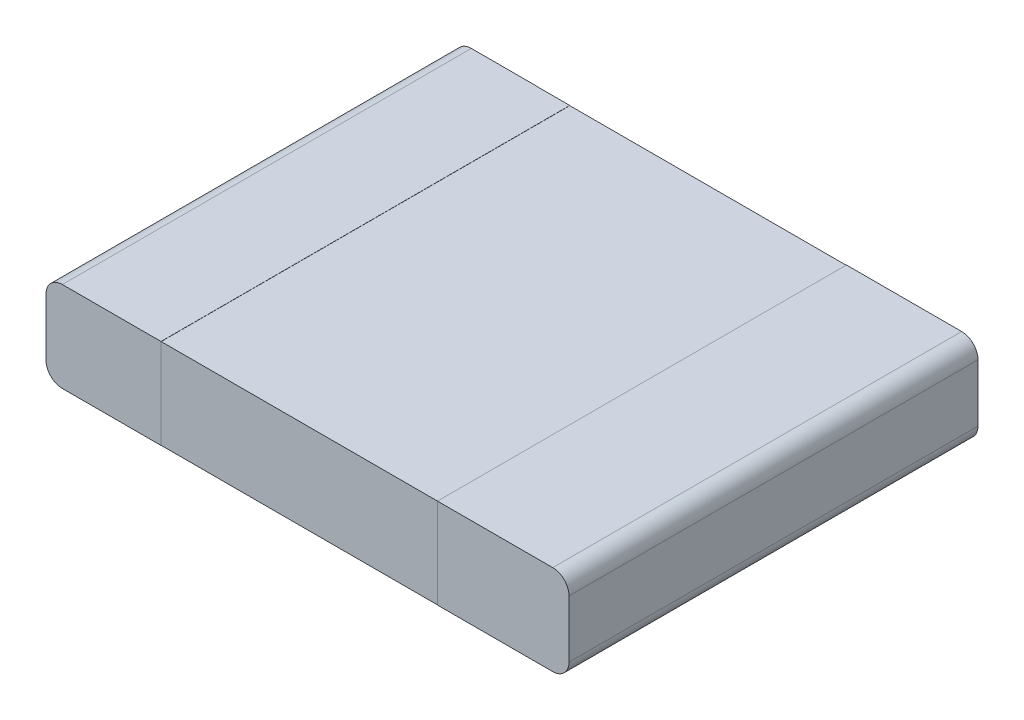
ISO-10303-21;
HEADER;
FILE_DESCRIPTION(('STEP AP214'),'2;1');
FILE_NAME('part.step','',(''),(''),'','','');
FILE_SCHEMA(('AUTOMOTIVE_DESIGN { 1 0 10303 214 1 1 1 1 }'));
ENDSEC;
DATA;
#1=APPLICATION_CONTEXT('core data for automotive mechanical design processes');
#2=APPLICATION_PROTOCOL_DEFINITION('international standard','automotive_design',2000,#1);
#3=PRODUCT_CONTEXT('',#1,'mechanical');
#4=PRODUCT('Part','Part','',(#3));
#5=PRODUCT_RELATED_PRODUCT_CATEGORY('part','',(#4));
#6=PRODUCT_DEFINITION_FORMATION('','',#4);
#7=PRODUCT_DEFINITION_CONTEXT('part definition',#1,'design');
#8=PRODUCT_DEFINITION('design','',#6,#7);
#9=PRODUCT_DEFINITION_SHAPE('','',#8);
#10=(LENGTH_UNIT() NAMED_UNIT(*) SI_UNIT(.MILLI.,.METRE.));
#11=(NAMED_UNIT(*) PLANE_ANGLE_UNIT() SI_UNIT($,.RADIAN.));
#12=(NAMED_UNIT(*) SI_UNIT($,.STERADIAN.) SOLID_ANGLE_UNIT());
#13=UNCERTAINTY_MEASURE_WITH_UNIT(LENGTH_MEASURE(1.E-05),#10,'distance_accuracy_value','');
#14=(GEOMETRIC_REPRESENTATION_CONTEXT(3) GLOBAL_UNCERTAINTY_ASSIGNED_CONTEXT((#13)) GLOBAL_UNIT_ASSIGNED_CONTEXT((#10,
#11,#12)) REPRESENTATION_CONTEXT('',''));
#15=CARTESIAN_POINT('',(0.,0.,0.));
#16=DIRECTION('',(0.,0.,1.));
#17=DIRECTION('',(1.,0.,0.));
#18=AXIS2_PLACEMENT_3D('',#15,#16,#17);
#19=CARTESIAN_POINT('',(0.,0.55,0.));
#20=DIRECTION('',(0.,1.,0.));
#21=DIRECTION('',(0.,0.,1.));
#22=AXIS2_PLACEMENT_3D('',#19,#20,#21);
#23=PLANE('',#22);
#24=DIRECTION('',(1.,0.,0.));
#25=VECTOR('',#24,1.);
#26=CARTESIAN_POINT('',(0.,0.55,-1.875));
#27=LINE('',#26,#25);
#28=CARTESIAN_POINT('',(1.39513527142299,0.55,-1.875));
#29=VERTEX_POINT('',#28);
#30=CARTESIAN_POINT('',(-0.296475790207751,0.55,-1.875));
#31=VERTEX_POINT('',#30);
#32=EDGE_CURVE('E225',#29,#31,#27,.F.);
#33=ORIENTED_EDGE('',*,*,#32,.T.);
#34=DIRECTION('',(0.,0.,1.));
#35=VECTOR('',#34,1.);
#36=CARTESIAN_POINT('',(-0.296475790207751,0.55,0.625));
#37=LINE('',#36,#35);
#38=CARTESIAN_POINT('',(-0.296475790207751,0.55,0.625));
#39=VERTEX_POINT('',#38);
#40=EDGE_CURVE('E206',#31,#39,#37,.T.);
#41=ORIENTED_EDGE('',*,*,#40,.T.);
#42=DIRECTION('',(1.,0.,0.));
#43=VECTOR('',#42,1.);
#44=CARTESIAN_POINT('',(0.,0.55,0.625));
#45=LINE('',#44,#43);
#46=CARTESIAN_POINT('',(1.39513527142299,0.55,0.625));
#47=VERTEX_POINT('',#46);
#48=EDGE_CURVE('E233',#39,#47,#45,.T.);
#49=ORIENTED_EDGE('',*,*,#48,.T.);
#50=DIRECTION('',(0.,0.,-1.));
#51=VECTOR('',#50,1.);
#52=CARTESIAN_POINT('',(1.39513527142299,0.55,0.625));
#53=LINE('',#52,#51);
#54=EDGE_CURVE('E228',#47,#29,#53,.T.);
#55=ORIENTED_EDGE('',*,*,#54,.T.);
#56=EDGE_LOOP('',(#33,#41,#49,#55));
#57=FACE_BOUND('',#56,.T.);
#58=ADVANCED_FACE('F19',(#57),#23,.T.);
#59=CARTESIAN_POINT('',(-0.296475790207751,0.551,0.625));
#60=DIRECTION('',(-1.,0.,0.));
#61=DIRECTION('',(0.,0.,1.));
#62=AXIS2_PLACEMENT_3D('',#59,#60,#61);
#63=PLANE('',#62);
#64=DIRECTION('',(0.,1.,0.));
#65=VECTOR('',#64,1.);
#66=CARTESIAN_POINT('',(-0.296475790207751,0.55,-1.875));
#67=LINE('',#66,#65);
#68=CARTESIAN_POINT('',(-0.296475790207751,0.551,-1.875));
#69=VERTEX_POINT('',#68);
#70=EDGE_CURVE('E204',#69,#31,#67,.F.);
#71=ORIENTED_EDGE('',*,*,#70,.F.);
#72=DIRECTION('',(0.,0.,1.));
#73=VECTOR('',#72,1.);
#74=CARTESIAN_POINT('',(-0.296475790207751,0.551,0.));
#75=LINE('',#74,#73);
#76=CARTESIAN_POINT('',(-0.296475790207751,0.551,0.626));
#77=VERTEX_POINT('',#76);
#78=EDGE_CURVE('E242',#77,#69,#75,.F.);
#79=ORIENTED_EDGE('',*,*,#78,.F.);
#80=DIRECTION('',(0.,1.,0.));
#81=VECTOR('',#80,1.);
#82=CARTESIAN_POINT('',(-0.296475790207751,0.551,0.626));
#83=LINE('',#82,#81);
#84=CARTESIAN_POINT('',(-0.296475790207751,0.,0.626));
#85=VERTEX_POINT('',#84);
#86=EDGE_CURVE('E207',#85,#77,#83,.T.);
#87=ORIENTED_EDGE('',*,*,#86,.F.);
#88=DIRECTION('',(0.,0.,1.));
#89=VECTOR('',#88,1.);
#90=CARTESIAN_POINT('',(-0.296475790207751,0.,0.));
#91=LINE('',#90,#89);
#92=CARTESIAN_POINT('',(-0.296475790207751,0.,0.625));
#93=VERTEX_POINT('',#92);
#94=EDGE_CURVE('E22',#93,#85,#91,.T.);
#95=ORIENTED_EDGE('',*,*,#94,.F.);
#96=DIRECTION('',(0.,1.,0.));
#97=VECTOR('',#96,1.);
#98=CARTESIAN_POINT('',(-0.296475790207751,0.551,0.625));
#99=LINE('',#98,#97);
#100=EDGE_CURVE('E125',#39,#93,#99,.F.);
#101=ORIENTED_EDGE('',*,*,#100,.F.);
#102=ORIENTED_EDGE('',*,*,#40,.F.);
#103=EDGE_LOOP('',(#71,#79,#87,#95,#101,#102));
#104=FACE_BOUND('',#103,.T.);
#105=ADVANCED_FACE('F240',(#104),#63,.F.);
#106=CARTESIAN_POINT('',(1.39513527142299,0.551,0.625));
#107=DIRECTION('',(1.,0.,0.));
#108=DIRECTION('',(0.,0.,-1.));
#109=AXIS2_PLACEMENT_3D('',#106,#107,#108);
#110=PLANE('',#109);
#111=DIRECTION('',(0.,1.,0.));
#112=VECTOR('',#111,1.);
#113=CARTESIAN_POINT('',(1.39513527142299,0.551,0.625));
#114=LINE('',#113,#112);
#115=CARTESIAN_POINT('',(1.39513527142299,0.,0.625));
#116=VERTEX_POINT('',#115);
#117=EDGE_CURVE('E198',#116,#47,#114,.T.);
#118=ORIENTED_EDGE('',*,*,#117,.F.);
#119=DIRECTION('',(0.,0.,1.));
#120=VECTOR('',#119,1.);
#121=CARTESIAN_POINT('',(1.39513527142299,0.,0.));
#122=LINE('',#121,#120);
#123=CARTESIAN_POINT('',(1.39513527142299,0.,0.626));
#124=VERTEX_POINT('',#123);
#125=EDGE_CURVE('E195',#124,#116,#122,.F.);
#126=ORIENTED_EDGE('',*,*,#125,.F.);
#127=DIRECTION('',(0.,1.,0.));
#128=VECTOR('',#127,1.);
#129=CARTESIAN_POINT('',(1.39513527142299,0.551,0.626));
#130=LINE('',#129,#128);
#131=CARTESIAN_POINT('',(1.39513527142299,0.551,0.626));
#132=VERTEX_POINT('',#131);
#133=EDGE_CURVE('E199',#132,#124,#130,.F.);
#134=ORIENTED_EDGE('',*,*,#133,.F.);
#135=DIRECTION('',(0.,0.,-1.));
#136=VECTOR('',#135,1.);
#137=CARTESIAN_POINT('',(1.39513527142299,0.551,0.));
#138=LINE('',#137,#136);
#139=CARTESIAN_POINT('',(1.39513527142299,0.551,-1.876));
#140=VERTEX_POINT('',#139);
#141=EDGE_CURVE('E193',#132,#140,#138,.T.);
#142=ORIENTED_EDGE('',*,*,#141,.T.);
#143=DIRECTION('',(0.,1.,0.));
#144=VECTOR('',#143,1.);
#145=CARTESIAN_POINT('',(1.39513527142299,0.551,-1.876));
#146=LINE('',#145,#144);
#147=CARTESIAN_POINT('',(1.39513527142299,0.,-1.876));
#148=VERTEX_POINT('',#147);
#149=EDGE_CURVE('E202',#148,#140,#146,.T.);
#150=ORIENTED_EDGE('',*,*,#149,.F.);
#151=DIRECTION('',(0.,0.,1.));
#152=VECTOR('',#151,1.);
#153=CARTESIAN_POINT('',(1.39513527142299,0.,0.));
#154=LINE('',#153,#152);
#155=CARTESIAN_POINT('',(1.39513527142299,0.,-1.875));
#156=VERTEX_POINT('',#155);
#157=EDGE_CURVE('E200',#156,#148,#154,.F.);
#158=ORIENTED_EDGE('',*,*,#157,.F.);
#159=DIRECTION('',(0.,1.,0.));
#160=VECTOR('',#159,1.);
#161=CARTESIAN_POINT('',(1.39513527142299,0.551,-1.875));
#162=LINE('',#161,#160);
#163=EDGE_CURVE('E203',#29,#156,#162,.F.);
#164=ORIENTED_EDGE('',*,*,#163,.F.);
#165=ORIENTED_EDGE('',*,*,#54,.F.);
#166=EDGE_LOOP('',(#118,#126,#134,#142,#150,#158,#164,#165));
#167=FACE_BOUND('',#166,.T.);
#168=ADVANCED_FACE('F284',(#167),#110,.F.);
#169=CARTESIAN_POINT('',(0.,0.551,0.));
#170=DIRECTION('',(0.,1.,0.));
#171=DIRECTION('',(0.,0.,1.));
#172=AXIS2_PLACEMENT_3D('',#169,#170,#171);
#173=PLANE('',#172);
#174=DIRECTION('',(1.,0.,0.));
#175=VECTOR('',#174,1.);
#176=CARTESIAN_POINT('',(0.,0.551,-1.875));
#177=LINE('',#176,#175);
#178=CARTESIAN_POINT('',(-0.500000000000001,0.551,-1.875));
#179=VERTEX_POINT('',#178);
#180=EDGE_CURVE('E194',#69,#179,#177,.F.);
#181=ORIENTED_EDGE('',*,*,#180,.T.);
#182=DIRECTION('',(0.,0.,1.));
#183=VECTOR('',#182,1.);
#184=CARTESIAN_POINT('',(-0.500000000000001,0.551,0.));
#185=LINE('',#184,#183);
#186=CARTESIAN_POINT('',(-0.500000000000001,0.551,-1.876));
#187=VERTEX_POINT('',#186);
#188=EDGE_CURVE('E191',#179,#187,#185,.F.);
#189=ORIENTED_EDGE('',*,*,#188,.T.);
#190=DIRECTION('',(1.,0.,0.));
#191=VECTOR('',#190,1.);
#192=CARTESIAN_POINT('',(0.,0.551,-1.876));
#193=LINE('',#192,#191);
#194=CARTESIAN_POINT('',(-0.900000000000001,0.551,-1.876));
#195=VERTEX_POINT('',#194);
#196=EDGE_CURVE('E147',#187,#195,#193,.F.);
#197=ORIENTED_EDGE('',*,*,#196,.T.);
#198=DIRECTION('',(0.,0.,-1.));
#199=VECTOR('',#198,1.);
#200=CARTESIAN_POINT('',(-0.9,0.551,0.));
#201=LINE('',#200,#199);
#202=CARTESIAN_POINT('',(-0.9,0.551,0.626));
#203=VERTEX_POINT('',#202);
#204=EDGE_CURVE('E185',#203,#195,#201,.T.);
#205=ORIENTED_EDGE('',*,*,#204,.F.);
#206=DIRECTION('',(1.,0.,0.));
#207=VECTOR('',#206,1.);
#208=CARTESIAN_POINT('',(0.,0.551,0.626));
#209=LINE('',#208,#207);
#210=EDGE_CURVE('E247',#203,#77,#209,.T.);
#211=ORIENTED_EDGE('',*,*,#210,.T.);
#212=ORIENTED_EDGE('',*,*,#78,.T.);
#213=EDGE_LOOP('',(#181,#189,#197,#205,#211,#212));
#214=FACE_BOUND('',#213,.T.);
#215=ADVANCED_FACE('F245',(#214),#173,.T.);
#216=CARTESIAN_POINT('',(0.,0.551,0.));
#217=DIRECTION('',(0.,-1.,0.));
#218=DIRECTION('',(0.,0.,-1.));
#219=AXIS2_PLACEMENT_3D('',#216,#217,#218);
#220=PLANE('',#219);
#221=DIRECTION('',(0.,0.,-1.));
#222=VECTOR('',#221,1.);
#223=CARTESIAN_POINT('',(2.1,0.551,0.));
#224=LINE('',#223,#222);
#225=CARTESIAN_POINT('',(2.1,0.551,-1.876));
#226=VERTEX_POINT('',#225);
#227=CARTESIAN_POINT('',(2.1,0.551,0.626));
#228=VERTEX_POINT('',#227);
#229=EDGE_CURVE('E182',#226,#228,#224,.F.);
#230=ORIENTED_EDGE('',*,*,#229,.F.);
#231=DIRECTION('',(1.,0.,0.));
#232=VECTOR('',#231,1.);
#233=CARTESIAN_POINT('',(0.,0.551,-1.876));
#234=LINE('',#233,#232);
#235=EDGE_CURVE('E263',#140,#226,#234,.T.);
#236=ORIENTED_EDGE('',*,*,#235,.F.);
#237=ORIENTED_EDGE('',*,*,#141,.F.);
#238=DIRECTION('',(1.,0.,0.));
#239=VECTOR('',#238,1.);
#240=CARTESIAN_POINT('',(0.,0.551,0.626));
#241=LINE('',#240,#239);
#242=EDGE_CURVE('E190',#228,#132,#241,.F.);
#243=ORIENTED_EDGE('',*,*,#242,.F.);
#244=EDGE_LOOP('',(#230,#236,#237,#243));
#245=FACE_BOUND('',#244,.T.);
#246=ADVANCED_FACE('F297',(#245),#220,.F.);
#247=CARTESIAN_POINT('',(-0.9,0.451,0.));
#248=DIRECTION('',(0.,0.,-1.));
#249=DIRECTION('',(-1.,0.,0.));
#250=AXIS2_PLACEMENT_3D('',#247,#248,#249);
#251=CYLINDRICAL_SURFACE('',#250,0.0999999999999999);
#252=CARTESIAN_POINT('',(-0.9,0.451,0.626));
#253=DIRECTION('',(0.,0.,-1.));
#254=DIRECTION('',(-1.,0.,0.));
#255=AXIS2_PLACEMENT_3D('',#252,#253,#254);
#256=CIRCLE('',#255,0.0999999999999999);
#257=CARTESIAN_POINT('',(-1.,0.451,0.626));
#258=VERTEX_POINT('',#257);
#259=EDGE_CURVE('E186',#258,#203,#256,.T.);
#260=ORIENTED_EDGE('',*,*,#259,.T.);
#261=ORIENTED_EDGE('',*,*,#204,.T.);
#262=CARTESIAN_POINT('',(-0.900000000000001,0.451,-1.876));
#263=DIRECTION('',(0.,0.,-1.));
#264=DIRECTION('',(-1.,0.,0.));
#265=AXIS2_PLACEMENT_3D('',#262,#263,#264);
#266=CIRCLE('',#265,0.0999999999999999);
#267=CARTESIAN_POINT('',(-1.,0.451,-1.876));
#268=VERTEX_POINT('',#267);
#269=EDGE_CURVE('E188',#195,#268,#266,.F.);
#270=ORIENTED_EDGE('',*,*,#269,.T.);
#271=DIRECTION('',(0.,0.,-1.));
#272=VECTOR('',#271,1.);
#273=CARTESIAN_POINT('',(-1.,0.451,-1.875));
#274=LINE('',#273,#272);
#275=EDGE_CURVE('E306',#268,#258,#274,.F.);
#276=ORIENTED_EDGE('',*,*,#275,.T.);
#277=EDGE_LOOP('',(#260,#261,#270,#276));
#278=FACE_BOUND('',#277,.T.);
#279=ADVANCED_FACE('F383',(#278),#251,.T.);
#280=CARTESIAN_POINT('',(2.1,0.451,0.));
#281=DIRECTION('',(0.,0.,-1.));
#282=DIRECTION('',(-1.,0.,0.));
#283=AXIS2_PLACEMENT_3D('',#280,#281,#282);
#284=CYLINDRICAL_SURFACE('',#283,0.0999999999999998);
#285=CARTESIAN_POINT('',(2.1,0.451,-1.876));
#286=DIRECTION('',(0.,0.,-1.));
#287=DIRECTION('',(-1.,0.,0.));
#288=AXIS2_PLACEMENT_3D('',#285,#286,#287);
#289=CIRCLE('',#288,0.0999999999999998);
#290=CARTESIAN_POINT('',(2.2,0.451,-1.876));
#291=VERTEX_POINT('',#290);
#292=EDGE_CURVE('E180',#291,#226,#289,.F.);
#293=ORIENTED_EDGE('',*,*,#292,.T.);
#294=ORIENTED_EDGE('',*,*,#229,.T.);
#295=CARTESIAN_POINT('',(2.1,0.451,0.626));
#296=DIRECTION('',(0.,0.,-1.));
#297=DIRECTION('',(-1.,0.,0.));
#298=AXIS2_PLACEMENT_3D('',#295,#296,#297);
#299=CIRCLE('',#298,0.0999999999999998);
#300=CARTESIAN_POINT('',(2.2,0.451,0.626));
#301=VERTEX_POINT('',#300);
#302=EDGE_CURVE('E183',#228,#301,#299,.T.);
#303=ORIENTED_EDGE('',*,*,#302,.T.);
#304=DIRECTION('',(0.,0.,1.));
#305=VECTOR('',#304,1.);
#306=CARTESIAN_POINT('',(2.2,0.451,-1.875));
#307=LINE('',#306,#305);
#308=EDGE_CURVE('E313',#301,#291,#307,.F.);
#309=ORIENTED_EDGE('',*,*,#308,.T.);
#310=EDGE_LOOP('',(#293,#294,#303,#309));
#311=FACE_BOUND('',#310,.T.);
#312=ADVANCED_FACE('F344',(#311),#284,.T.);
#313=CARTESIAN_POINT('',(-1.,0.55,-1.875));
#314=DIRECTION('',(1.,0.,0.));
#315=DIRECTION('',(0.,0.,-1.));
#316=AXIS2_PLACEMENT_3D('',#313,#314,#315);
#317=PLANE('',#316);
#318=DIRECTION('',(0.,0.,1.));
#319=VECTOR('',#318,1.);
#320=CARTESIAN_POINT('',(-1.,0.1,-1.875));
#321=LINE('',#320,#319);
#322=CARTESIAN_POINT('',(-1.,0.1,0.626));
#323=VERTEX_POINT('',#322);
#324=CARTESIAN_POINT('',(-1.,0.1,-1.876));
#325=VERTEX_POINT('',#324);
#326=EDGE_CURVE('E178',#323,#325,#321,.F.);
#327=ORIENTED_EDGE('',*,*,#326,.F.);
#328=DIRECTION('',(0.,1.,0.));
#329=VECTOR('',#328,1.);
#330=CARTESIAN_POINT('',(-1.,0.55,0.626));
#331=LINE('',#330,#329);
#332=EDGE_CURVE('E311',#258,#323,#331,.F.);
#333=ORIENTED_EDGE('',*,*,#332,.F.);
#334=ORIENTED_EDGE('',*,*,#275,.F.);
#335=DIRECTION('',(0.,1.,0.));
#336=VECTOR('',#335,1.);
#337=CARTESIAN_POINT('',(-1.,0.,-1.876));
#338=LINE('',#337,#336);
#339=EDGE_CURVE('E149',#325,#268,#338,.T.);
#340=ORIENTED_EDGE('',*,*,#339,.F.);
#341=EDGE_LOOP('',(#327,#333,#334,#340));
#342=FACE_BOUND('',#341,.T.);
#343=ADVANCED_FACE('F377',(#342),#317,.F.);
#344=CARTESIAN_POINT('',(2.2,0.55,-1.875));
#345=DIRECTION('',(-1.,0.,0.));
#346=DIRECTION('',(0.,0.,1.));
#347=AXIS2_PLACEMENT_3D('',#344,#345,#346);
#348=PLANE('',#347);
#349=DIRECTION('',(0.,0.,-1.));
#350=VECTOR('',#349,1.);
#351=CARTESIAN_POINT('',(2.2,0.1,-1.875));
#352=LINE('',#351,#350);
#353=CARTESIAN_POINT('',(2.2,0.1,-1.876));
#354=VERTEX_POINT('',#353);
#355=CARTESIAN_POINT('',(2.2,0.1,0.626));
#356=VERTEX_POINT('',#355);
#357=EDGE_CURVE('E171',#354,#356,#352,.F.);
#358=ORIENTED_EDGE('',*,*,#357,.F.);
#359=DIRECTION('',(0.,1.,0.));
#360=VECTOR('',#359,1.);
#361=CARTESIAN_POINT('',(2.2,0.55,-1.876));
#362=LINE('',#361,#360);
#363=EDGE_CURVE('E318',#291,#354,#362,.F.);
#364=ORIENTED_EDGE('',*,*,#363,.F.);
#365=ORIENTED_EDGE('',*,*,#308,.F.);
#366=DIRECTION('',(0.,1.,0.));
#367=VECTOR('',#366,1.);
#368=CARTESIAN_POINT('',(2.2,0.,0.626));
#369=LINE('',#368,#367);
#370=EDGE_CURVE('E174',#356,#301,#369,.T.);
#371=ORIENTED_EDGE('',*,*,#370,.F.);
#372=EDGE_LOOP('',(#358,#364,#365,#371));
#373=FACE_BOUND('',#372,.T.);
#374=ADVANCED_FACE('F341',(#373),#348,.F.);
#375=CARTESIAN_POINT('',(-1.,0.55,-1.875));
#376=DIRECTION('',(0.,0.,1.));
#377=DIRECTION('',(1.,0.,0.));
#378=AXIS2_PLACEMENT_3D('',#375,#376,#377);
#379=PLANE('',#378);
#380=ORIENTED_EDGE('',*,*,#180,.F.);
#381=ORIENTED_EDGE('',*,*,#70,.T.);
#382=ORIENTED_EDGE('',*,*,#32,.F.);
#383=ORIENTED_EDGE('',*,*,#163,.T.);
#384=DIRECTION('',(1.,0.,0.));
#385=VECTOR('',#384,1.);
#386=CARTESIAN_POINT('',(0.,0.,-1.875));
#387=LINE('',#386,#385);
#388=CARTESIAN_POINT('',(-0.500000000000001,0.,-1.875));
#389=VERTEX_POINT('',#388);
#390=EDGE_CURVE('E163',#156,#389,#387,.F.);
#391=ORIENTED_EDGE('',*,*,#390,.T.);
#392=DIRECTION('',(0.,1.,0.));
#393=VECTOR('',#392,1.);
#394=CARTESIAN_POINT('',(-0.500000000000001,0.,-1.875));
#395=LINE('',#394,#393);
#396=EDGE_CURVE('E134',#389,#179,#395,.T.);
#397=ORIENTED_EDGE('',*,*,#396,.T.);
#398=EDGE_LOOP('',(#380,#381,#382,#383,#391,#397));
#399=FACE_BOUND('',#398,.T.);
#400=ADVANCED_FACE('F249',(#399),#379,.F.);
#401=CARTESIAN_POINT('',(-0.500000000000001,0.,-1.876));
#402=DIRECTION('',(-1.,0.,0.));
#403=DIRECTION('',(0.,0.,1.));
#404=AXIS2_PLACEMENT_3D('',#401,#402,#403);
#405=PLANE('',#404);
#406=DIRECTION('',(0.,0.,1.));
#407=VECTOR('',#406,1.);
#408=CARTESIAN_POINT('',(-0.500000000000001,0.,-1.876));
#409=LINE('',#408,#407);
#410=CARTESIAN_POINT('',(-0.500000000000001,0.,-1.876));
#411=VERTEX_POINT('',#410);
#412=EDGE_CURVE('E156',#389,#411,#409,.F.);
#413=ORIENTED_EDGE('',*,*,#412,.T.);
#414=DIRECTION('',(0.,1.,0.));
#415=VECTOR('',#414,1.);
#416=CARTESIAN_POINT('',(-0.500000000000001,0.,-1.876));
#417=LINE('',#416,#415);
#418=EDGE_CURVE('E141',#187,#411,#417,.F.);
#419=ORIENTED_EDGE('',*,*,#418,.F.);
#420=ORIENTED_EDGE('',*,*,#188,.F.);
#421=ORIENTED_EDGE('',*,*,#396,.F.);
#422=EDGE_LOOP('',(#413,#419,#420,#421));
#423=FACE_BOUND('',#422,.T.);
#424=ADVANCED_FACE('F162',(#423),#405,.F.);
#425=CARTESIAN_POINT('',(0.,0.,-1.876));
#426=DIRECTION('',(0.,0.,-1.));
#427=DIRECTION('',(-1.,0.,0.));
#428=AXIS2_PLACEMENT_3D('',#425,#426,#427);
#429=PLANE('',#428);
#430=ORIENTED_EDGE('',*,*,#196,.F.);
#431=ORIENTED_EDGE('',*,*,#418,.T.);
#432=DIRECTION('',(1.,0.,0.));
#433=VECTOR('',#432,1.);
#434=CARTESIAN_POINT('',(0.,0.,-1.876));
#435=LINE('',#434,#433);
#436=CARTESIAN_POINT('',(-0.9,0.,-1.876));
#437=VERTEX_POINT('',#436);
#438=EDGE_CURVE('E145',#411,#437,#435,.F.);
#439=ORIENTED_EDGE('',*,*,#438,.T.);
#440=CARTESIAN_POINT('',(-0.9,0.1,-1.876));
#441=DIRECTION('',(0.,0.,1.));
#442=DIRECTION('',(1.,0.,0.));
#443=AXIS2_PLACEMENT_3D('',#440,#441,#442);
#444=CIRCLE('',#443,0.1);
#445=EDGE_CURVE('E148',#325,#437,#444,.T.);
#446=ORIENTED_EDGE('',*,*,#445,.F.);
#447=ORIENTED_EDGE('',*,*,#339,.T.);
#448=ORIENTED_EDGE('',*,*,#269,.F.);
#449=EDGE_LOOP('',(#430,#431,#439,#446,#447,#448));
#450=FACE_BOUND('',#449,.T.);
#451=ADVANCED_FACE('F143',(#450),#429,.T.);
#452=CARTESIAN_POINT('',(-0.9,0.1,-1.875));
#453=DIRECTION('',(0.,0.,1.));
#454=DIRECTION('',(1.,0.,0.));
#455=AXIS2_PLACEMENT_3D('',#452,#453,#454);
#456=CYLINDRICAL_SURFACE('',#455,0.1);
#457=CARTESIAN_POINT('',(-0.9,0.1,0.626));
#458=DIRECTION('',(0.,0.,1.));
#459=DIRECTION('',(1.,0.,0.));
#460=AXIS2_PLACEMENT_3D('',#457,#458,#459);
#461=CIRCLE('',#460,0.1);
#462=CARTESIAN_POINT('',(-0.9,0.,0.626));
#463=VERTEX_POINT('',#462);
#464=EDGE_CURVE('E175',#463,#323,#461,.F.);
#465=ORIENTED_EDGE('',*,*,#464,.T.);
#466=ORIENTED_EDGE('',*,*,#326,.T.);
#467=ORIENTED_EDGE('',*,*,#445,.T.);
#468=DIRECTION('',(0.,0.,1.));
#469=VECTOR('',#468,1.);
#470=CARTESIAN_POINT('',(-0.9,0.,0.));
#471=LINE('',#470,#469);
#472=EDGE_CURVE('E160',#437,#463,#471,.T.);
#473=ORIENTED_EDGE('',*,*,#472,.T.);
#474=EDGE_LOOP('',(#465,#466,#467,#473));
#475=FACE_BOUND('',#474,.T.);
#476=ADVANCED_FACE('F365',(#475),#456,.T.);
#477=CARTESIAN_POINT('',(0.,0.,0.626));
#478=DIRECTION('',(0.,0.,-1.));
#479=DIRECTION('',(-1.,0.,0.));
#480=AXIS2_PLACEMENT_3D('',#477,#478,#479);
#481=PLANE('',#480);
#482=ORIENTED_EDGE('',*,*,#464,.F.);
#483=DIRECTION('',(1.,0.,0.));
#484=VECTOR('',#483,1.);
#485=CARTESIAN_POINT('',(0.,0.,0.626));
#486=LINE('',#485,#484);
#487=EDGE_CURVE('E326',#463,#85,#486,.T.);
#488=ORIENTED_EDGE('',*,*,#487,.T.);
#489=ORIENTED_EDGE('',*,*,#86,.T.);
#490=ORIENTED_EDGE('',*,*,#210,.F.);
#491=ORIENTED_EDGE('',*,*,#259,.F.);
#492=ORIENTED_EDGE('',*,*,#332,.T.);
#493=EDGE_LOOP('',(#482,#488,#489,#490,#491,#492));
#494=FACE_BOUND('',#493,.T.);
#495=ADVANCED_FACE('F361',(#494),#481,.F.);
#496=CARTESIAN_POINT('',(-1.,0.55,0.625));
#497=DIRECTION('',(0.,0.,-1.));
#498=DIRECTION('',(-1.,0.,0.));
#499=AXIS2_PLACEMENT_3D('',#496,#497,#498);
#500=PLANE('',#499);
#501=ORIENTED_EDGE('',*,*,#48,.F.);
#502=ORIENTED_EDGE('',*,*,#100,.T.);
#503=DIRECTION('',(1.,0.,0.));
#504=VECTOR('',#503,1.);
#505=CARTESIAN_POINT('',(0.,0.,0.625));
#506=LINE('',#505,#504);
#507=EDGE_CURVE('E332',#93,#116,#506,.T.);
#508=ORIENTED_EDGE('',*,*,#507,.T.);
#509=ORIENTED_EDGE('',*,*,#117,.T.);
#510=EDGE_LOOP('',(#501,#502,#508,#509));
#511=FACE_BOUND('',#510,.T.);
#512=ADVANCED_FACE('F358',(#511),#500,.F.);
#513=CARTESIAN_POINT('',(0.,0.,0.626));
#514=DIRECTION('',(0.,0.,1.));
#515=DIRECTION('',(1.,0.,0.));
#516=AXIS2_PLACEMENT_3D('',#513,#514,#515);
#517=PLANE('',#516);
#518=ORIENTED_EDGE('',*,*,#242,.T.);
#519=ORIENTED_EDGE('',*,*,#133,.T.);
#520=DIRECTION('',(1.,0.,0.));
#521=VECTOR('',#520,1.);
#522=CARTESIAN_POINT('',(0.,0.,0.626));
#523=LINE('',#522,#521);
#524=CARTESIAN_POINT('',(2.1,0.,0.626));
#525=VERTEX_POINT('',#524);
#526=EDGE_CURVE('E329',#124,#525,#523,.T.);
#527=ORIENTED_EDGE('',*,*,#526,.T.);
#528=CARTESIAN_POINT('',(2.1,0.1,0.626));
#529=DIRECTION('',(0.,0.,-1.));
#530=DIRECTION('',(-1.,0.,0.));
#531=AXIS2_PLACEMENT_3D('',#528,#529,#530);
#532=CIRCLE('',#531,0.0999999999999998);
#533=EDGE_CURVE('E172',#356,#525,#532,.T.);
#534=ORIENTED_EDGE('',*,*,#533,.F.);
#535=ORIENTED_EDGE('',*,*,#370,.T.);
#536=ORIENTED_EDGE('',*,*,#302,.F.);
#537=EDGE_LOOP('',(#518,#519,#527,#534,#535,#536));
#538=FACE_BOUND('',#537,.T.);
#539=ADVANCED_FACE('F301',(#538),#517,.T.);
#540=CARTESIAN_POINT('',(2.1,0.1,-1.875));
#541=DIRECTION('',(0.,0.,-1.));
#542=DIRECTION('',(-1.,0.,0.));
#543=AXIS2_PLACEMENT_3D('',#540,#541,#542);
#544=CYLINDRICAL_SURFACE('',#543,0.0999999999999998);
#545=CARTESIAN_POINT('',(2.1,0.1,-1.876));
#546=DIRECTION('',(0.,0.,-1.));
#547=DIRECTION('',(-1.,0.,0.));
#548=AXIS2_PLACEMENT_3D('',#545,#546,#547);
#549=CIRCLE('',#548,0.0999999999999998);
#550=CARTESIAN_POINT('',(2.1,0.,-1.876));
#551=VERTEX_POINT('',#550);
#552=EDGE_CURVE('E36',#551,#354,#549,.F.);
#553=ORIENTED_EDGE('',*,*,#552,.T.);
#554=ORIENTED_EDGE('',*,*,#357,.T.);
#555=ORIENTED_EDGE('',*,*,#533,.T.);
#556=DIRECTION('',(0.,0.,1.));
#557=VECTOR('',#556,1.);
#558=CARTESIAN_POINT('',(2.1,0.,0.));
#559=LINE('',#558,#557);
#560=EDGE_CURVE('E28',#525,#551,#559,.F.);
#561=ORIENTED_EDGE('',*,*,#560,.T.);
#562=EDGE_LOOP('',(#553,#554,#555,#561));
#563=FACE_BOUND('',#562,.T.);
#564=ADVANCED_FACE('F337',(#563),#544,.T.);
#565=CARTESIAN_POINT('',(0.,0.,-1.876));
#566=DIRECTION('',(0.,0.,1.));
#567=DIRECTION('',(1.,0.,0.));
#568=AXIS2_PLACEMENT_3D('',#565,#566,#567);
#569=PLANE('',#568);
#570=ORIENTED_EDGE('',*,*,#552,.F.);
#571=DIRECTION('',(1.,0.,0.));
#572=VECTOR('',#571,1.);
#573=CARTESIAN_POINT('',(0.,0.,-1.876));
#574=LINE('',#573,#572);
#575=EDGE_CURVE('E11',#551,#148,#574,.F.);
#576=ORIENTED_EDGE('',*,*,#575,.T.);
#577=ORIENTED_EDGE('',*,*,#149,.T.);
#578=ORIENTED_EDGE('',*,*,#235,.T.);
#579=ORIENTED_EDGE('',*,*,#292,.F.);
#580=ORIENTED_EDGE('',*,*,#363,.T.);
#581=EDGE_LOOP('',(#570,#576,#577,#578,#579,#580));
#582=FACE_BOUND('',#581,.T.);
#583=ADVANCED_FACE('F345',(#582),#569,.F.);
#584=CARTESIAN_POINT('',(0.,0.,0.));
#585=DIRECTION('',(0.,1.,0.));
#586=DIRECTION('',(0.,0.,1.));
#587=AXIS2_PLACEMENT_3D('',#584,#585,#586);
#588=PLANE('',#587);
#589=ORIENTED_EDGE('',*,*,#560,.F.);
#590=ORIENTED_EDGE('',*,*,#526,.F.);
#591=ORIENTED_EDGE('',*,*,#125,.T.);
#592=ORIENTED_EDGE('',*,*,#507,.F.);
#593=ORIENTED_EDGE('',*,*,#94,.T.);
#594=ORIENTED_EDGE('',*,*,#487,.F.);
#595=ORIENTED_EDGE('',*,*,#472,.F.);
#596=ORIENTED_EDGE('',*,*,#438,.F.);
#597=ORIENTED_EDGE('',*,*,#412,.F.);
#598=ORIENTED_EDGE('',*,*,#390,.F.);
#599=ORIENTED_EDGE('',*,*,#157,.T.);
#600=ORIENTED_EDGE('',*,*,#575,.F.);
#601=EDGE_LOOP('',(#589,#590,#591,#592,#593,#594,#595,#596,#597,#598,#599,#600));
#602=FACE_BOUND('',#601,.T.);
#603=ADVANCED_FACE('F154',(#602),#588,.F.);
#604=CLOSED_SHELL('',(#58,#105,#168,#215,#246,#279,#312,#343,#374,#400,#424,#451,#476,#495,#512,
#539,#564,#583,#603));
#605=MANIFOLD_SOLID_BREP('B1',#604);
#606=ADVANCED_BREP_SHAPE_REPRESENTATION('',(#18,#605),#14);
#607=SHAPE_DEFINITION_REPRESENTATION(#9,#606);
ENDSEC;
END-ISO-10303-21;
